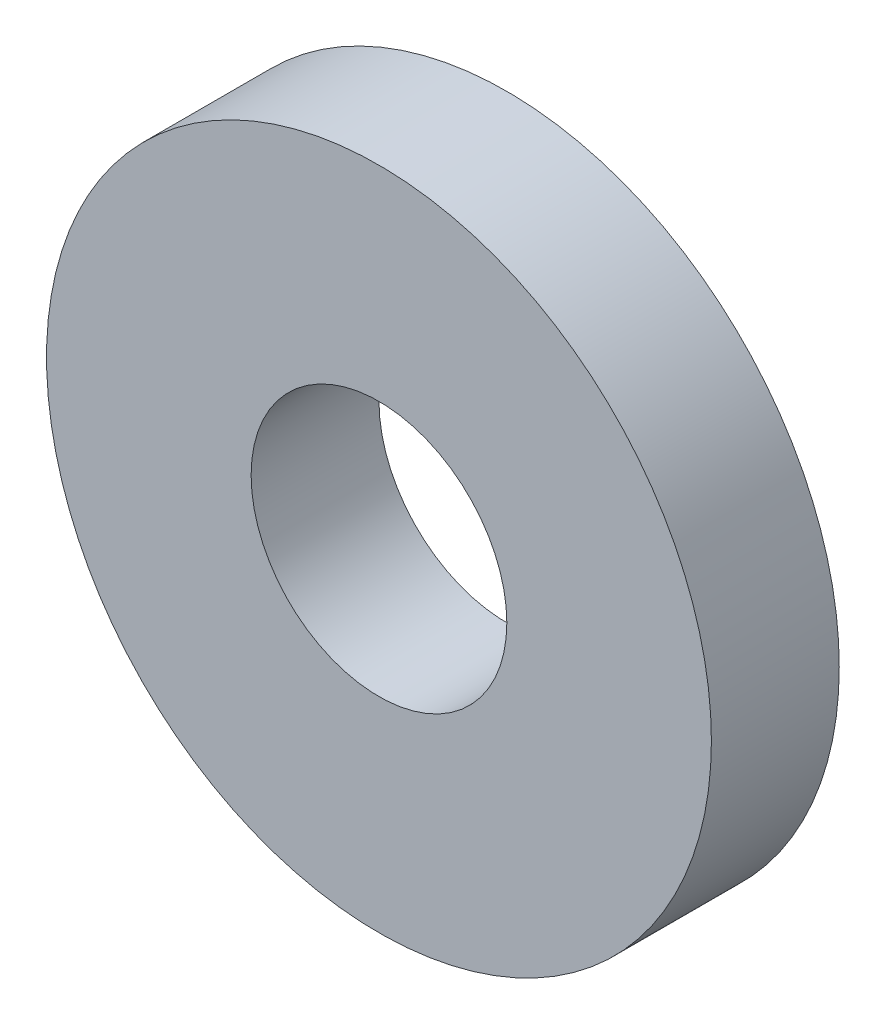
ISO-10303-21;
HEADER;
FILE_DESCRIPTION(('STEP AP214'),'2;1');
FILE_NAME('part.step','',(''),(''),'','','');
FILE_SCHEMA(('AUTOMOTIVE_DESIGN { 1 0 10303 214 1 1 1 1 }'));
ENDSEC;
DATA;
#1=APPLICATION_CONTEXT('core data for automotive mechanical design processes');
#2=APPLICATION_PROTOCOL_DEFINITION('international standard','automotive_design',2000,#1);
#3=PRODUCT_CONTEXT('',#1,'mechanical');
#4=PRODUCT('Part','Part','',(#3));
#5=PRODUCT_RELATED_PRODUCT_CATEGORY('part','',(#4));
#6=PRODUCT_DEFINITION_FORMATION('','',#4);
#7=PRODUCT_DEFINITION_CONTEXT('part definition',#1,'design');
#8=PRODUCT_DEFINITION('design','',#6,#7);
#9=PRODUCT_DEFINITION_SHAPE('','',#8);
#10=(LENGTH_UNIT() NAMED_UNIT(*) SI_UNIT(.MILLI.,.METRE.));
#11=(NAMED_UNIT(*) PLANE_ANGLE_UNIT() SI_UNIT($,.RADIAN.));
#12=(NAMED_UNIT(*) SI_UNIT($,.STERADIAN.) SOLID_ANGLE_UNIT());
#13=UNCERTAINTY_MEASURE_WITH_UNIT(LENGTH_MEASURE(1.E-05),#10,'distance_accuracy_value','');
#14=(GEOMETRIC_REPRESENTATION_CONTEXT(3) GLOBAL_UNCERTAINTY_ASSIGNED_CONTEXT((#13)) GLOBAL_UNIT_ASSIGNED_CONTEXT((#10,
#11,#12)) REPRESENTATION_CONTEXT('',''));
#15=CARTESIAN_POINT('',(0.,0.,0.));
#16=DIRECTION('',(0.,0.,1.));
#17=DIRECTION('',(1.,0.,0.));
#18=AXIS2_PLACEMENT_3D('',#15,#16,#17);
#19=CARTESIAN_POINT('',(-54.2784577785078,4.64755636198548,5.));
#20=DIRECTION('',(0.,0.,-1.));
#21=DIRECTION('',(-1.,0.,0.));
#22=AXIS2_PLACEMENT_3D('',#19,#20,#21);
#23=CYLINDRICAL_SURFACE('',#22,13.);
#24=CARTESIAN_POINT('',(-54.2784577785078,4.64755636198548,5.));
#25=DIRECTION('',(0.,0.,1.));
#26=DIRECTION('',(1.,0.,0.));
#27=AXIS2_PLACEMENT_3D('',#24,#25,#26);
#28=CIRCLE('',#27,13.);
#29=CARTESIAN_POINT('',(-41.2784577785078,4.64755636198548,5.));
#30=VERTEX_POINT('',#29);
#31=EDGE_CURVE('E10',#30,#30,#28,.T.);
#32=ORIENTED_EDGE('',*,*,#31,.F.);
#33=EDGE_LOOP('',(#32));
#34=FACE_BOUND('',#33,.T.);
#35=CARTESIAN_POINT('',(-54.2784577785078,4.64755636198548,0.));
#36=DIRECTION('',(0.,0.,1.));
#37=DIRECTION('',(1.,0.,0.));
#38=AXIS2_PLACEMENT_3D('',#35,#36,#37);
#39=CIRCLE('',#38,13.);
#40=CARTESIAN_POINT('',(-41.2784577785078,4.64755636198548,0.));
#41=VERTEX_POINT('',#40);
#42=EDGE_CURVE('E35',#41,#41,#39,.T.);
#43=ORIENTED_EDGE('',*,*,#42,.T.);
#44=EDGE_LOOP('',(#43));
#45=FACE_BOUND('',#44,.T.);
#46=ADVANCED_FACE('F32',(#34,#45),#23,.T.);
#47=CARTESIAN_POINT('',(-54.2784577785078,4.64755636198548,5.));
#48=DIRECTION('',(0.,0.,1.));
#49=DIRECTION('',(1.,0.,0.));
#50=AXIS2_PLACEMENT_3D('',#47,#48,#49);
#51=PLANE('',#50);
#52=CARTESIAN_POINT('',(-54.2784577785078,4.64755636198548,5.));
#53=DIRECTION('',(0.,0.,1.));
#54=DIRECTION('',(1.,0.,0.));
#55=AXIS2_PLACEMENT_3D('',#52,#53,#54);
#56=CIRCLE('',#55,5.);
#57=CARTESIAN_POINT('',(-49.2784577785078,4.64755636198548,5.));
#58=VERTEX_POINT('',#57);
#59=EDGE_CURVE('E44',#58,#58,#56,.T.);
#60=ORIENTED_EDGE('',*,*,#59,.F.);
#61=EDGE_LOOP('',(#60));
#62=FACE_BOUND('',#61,.T.);
#63=ORIENTED_EDGE('',*,*,#31,.T.);
#64=EDGE_LOOP('',(#63));
#65=FACE_BOUND('',#64,.T.);
#66=ADVANCED_FACE('F59',(#62,#65),#51,.T.);
#67=CARTESIAN_POINT('',(-54.2784577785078,4.64755636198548,0.));
#68=DIRECTION('',(0.,0.,1.));
#69=DIRECTION('',(1.,0.,0.));
#70=AXIS2_PLACEMENT_3D('',#67,#68,#69);
#71=PLANE('',#70);
#72=CARTESIAN_POINT('',(-54.2784577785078,4.64755636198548,0.));
#73=DIRECTION('',(0.,0.,1.));
#74=DIRECTION('',(1.,0.,0.));
#75=AXIS2_PLACEMENT_3D('',#72,#73,#74);
#76=CIRCLE('',#75,5.);
#77=CARTESIAN_POINT('',(-49.2784577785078,4.64755636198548,0.));
#78=VERTEX_POINT('',#77);
#79=EDGE_CURVE('E42',#78,#78,#76,.T.);
#80=ORIENTED_EDGE('',*,*,#79,.T.);
#81=EDGE_LOOP('',(#80));
#82=FACE_BOUND('',#81,.T.);
#83=ORIENTED_EDGE('',*,*,#42,.F.);
#84=EDGE_LOOP('',(#83));
#85=FACE_BOUND('',#84,.T.);
#86=ADVANCED_FACE('F50',(#82,#85),#71,.F.);
#87=CARTESIAN_POINT('',(-54.2784577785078,4.64755636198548,0.));
#88=DIRECTION('',(0.,0.,1.));
#89=DIRECTION('',(1.,0.,0.));
#90=AXIS2_PLACEMENT_3D('',#87,#88,#89);
#91=CYLINDRICAL_SURFACE('',#90,5.);
#92=ORIENTED_EDGE('',*,*,#79,.F.);
#93=EDGE_LOOP('',(#92));
#94=FACE_BOUND('',#93,.T.);
#95=ORIENTED_EDGE('',*,*,#59,.T.);
#96=EDGE_LOOP('',(#95));
#97=FACE_BOUND('',#96,.T.);
#98=ADVANCED_FACE('F53',(#94,#97),#91,.F.);
#99=CLOSED_SHELL('',(#46,#66,#86,#98));
#100=MANIFOLD_SOLID_BREP('B2',#99);
#101=ADVANCED_BREP_SHAPE_REPRESENTATION('',(#18,#100),#14);
#102=SHAPE_DEFINITION_REPRESENTATION(#9,#101);
ENDSEC;
END-ISO-10303-21;
